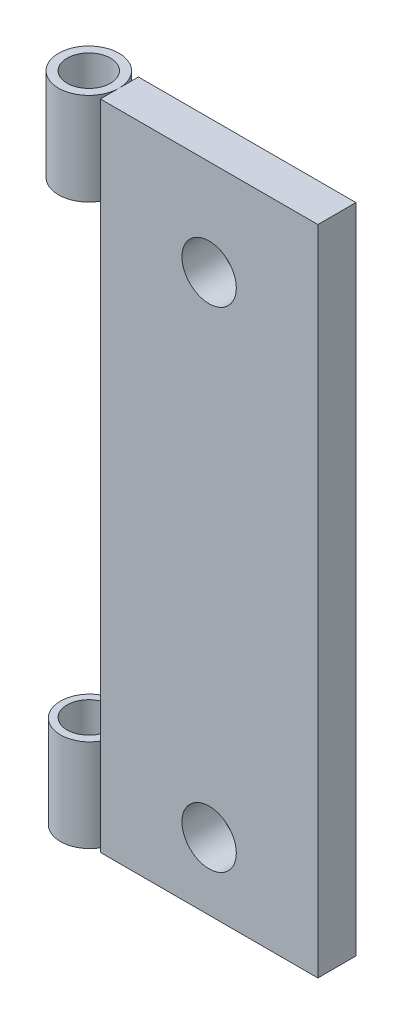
from build123d import *

# Parameters (mm, degrees)
SKETCH1_W           = 40
SKETCH1_H           = 120
BOSS_EXTRUDE1_DEPTH = 7
SKETCH3_R           = 5.562182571
BOSS_EXTRUDE2_DEPTH = 17
SKETCH4_R           = 4
CUT_EXTRUDE1_DEPTH  = 108.986189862
SKETCH5_R           = 5.385332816
BOSS_EXTRUDE3_DEPTH = 17
SKETCH6_R           = 4
CUT_EXTRUDE2_DEPTH  = 108.986189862
SKETCH7_R           = 5
CUT_EXTRUDE3_DEPTH  = 69.188632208


with BuildPart() as part:
    # Sketch1 → Boss-Extrude1 (new body)
    with BuildSketch(Plane.XY):
        Rectangle(SKETCH1_W, SKETCH1_H)
    extrude(amount=BOSS_EXTRUDE1_DEPTH)

    # Sketch7 → Cut-Extrude3 (cut, through all)
    with BuildSketch(Plane.XY.offset(7)):
        with Locations((0, 42.381921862)):
            Circle(SKETCH7_R)
        with Locations((0, -47.618078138)):
            Circle(SKETCH7_R)
    extrude(amount=-CUT_EXTRUDE3_DEPTH, mode=Mode.SUBTRACT)


with BuildPart() as body_2:
    # Sketch3 → Boss-Extrude2 (new body)
    with BuildSketch(Plane(origin=(0, 60, 0), x_dir=(1, 0, 0), z_dir=(0, 1, 0))):
        with Locations(Location((-25.562182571, -3.564212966, 0), (0, 0, 270))):
            Circle(SKETCH3_R)
    extrude(amount=-BOSS_EXTRUDE2_DEPTH)

    # Sketch4 → Cut-Extrude1 (cut, through all)
    with BuildSketch(Plane.XZ.offset(-43)):
        with Locations(Location((-25.562182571, 3.564212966, 0), (0, 0, 270))):
            Circle(SKETCH4_R)
    extrude(amount=-CUT_EXTRUDE1_DEPTH, mode=Mode.SUBTRACT)


with BuildPart() as body_3:
    # Sketch5 → Boss-Extrude3 (new body)
    with BuildSketch(Plane.XZ.offset(60)):
        with Locations(Location((-25.385332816, 3.564212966, 0), (0, 0, 270))):
            Circle(SKETCH5_R)
    extrude(amount=-BOSS_EXTRUDE3_DEPTH)

    # Sketch6 → Cut-Extrude2 (cut, through all)
    with BuildSketch(Plane(origin=(0, -43, 0), x_dir=(1, 0, 0), z_dir=(0, 1, 0))):
        with Locations(Location((-25.562182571, -3.564212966, 0), (0, 0, 270))):
            Circle(SKETCH6_R)
    extrude(amount=-CUT_EXTRUDE2_DEPTH, mode=Mode.SUBTRACT)


solid = Compound([part.part, body_2.part, body_3.part])
